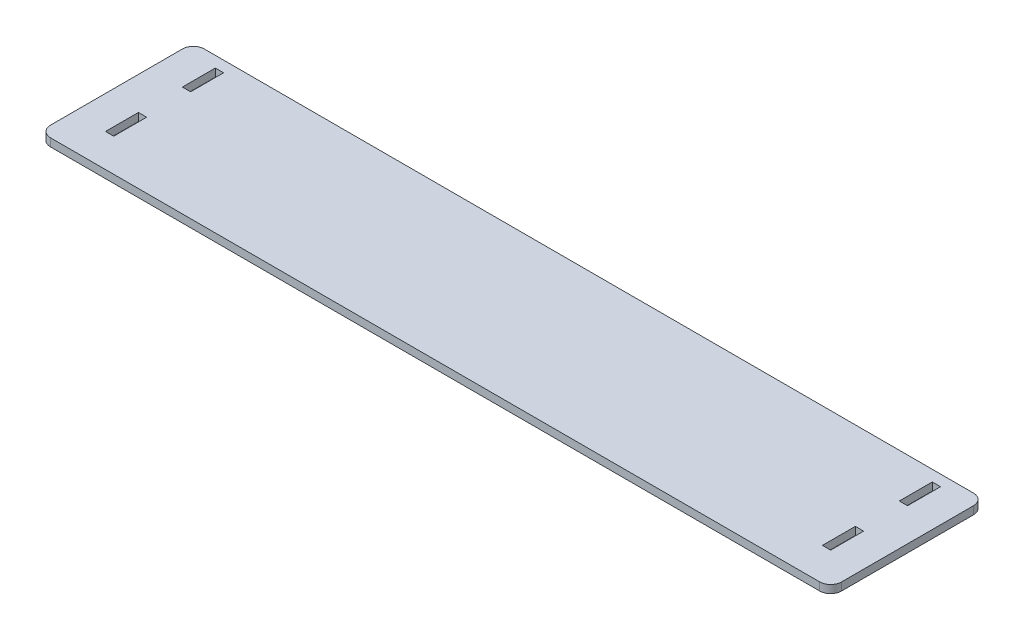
from build123d import *

# Parameters (mm, degrees)
SKETCH1_W           = 1828.8
SKETCH1_H           = 355.6
BOSS_EXTRUDE1_DEPTH = 18.288
FILLET1_R           = 25.4
SKETCH2_W           = 19.05
SKETCH2_H           = 76.2
CUT_EXTRUDE1_DEPTH  = 932.705238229


with BuildPart() as part:
    # Sketch1 → Boss-Extrude1 (new body)
    with BuildSketch(Plane(origin=(0, 0, 0), x_dir=(1, 0, 0), z_dir=(0, 1, 0))):
        Rectangle(SKETCH1_W, SKETCH1_H)
    extrude(amount=BOSS_EXTRUDE1_DEPTH)

    # Fillet1
    fillet1_edges = [part.edges().sort_by_distance(p)[0] for p in [
        (-914.4, 9.144, -177.8),
        (914.4, 9.144, -177.8),
        (914.4, 9.144, 177.8),
        (-914.4, 9.144, 177.8),
    ]]
    fillet(fillet1_edges, radius=FILLET1_R)

    # Sketch2 → Cut-Extrude1 (cut, through all)
    with BuildSketch(Plane(origin=(0, 18.288, 0), x_dir=(1, 0, 0), z_dir=(0, 1, 0))):
        with Locations((-828.675, 114.3)):
            Rectangle(SKETCH2_W, SKETCH2_H)
        with Locations((-828.675, -63.5)):
            Rectangle(SKETCH2_W, SKETCH2_H)
    cut_extrude1 = extrude(amount=-CUT_EXTRUDE1_DEPTH, mode=Mode.SUBTRACT)

    # Mirror1: Cut-Extrude1 across plane
    add(cut_extrude1.mirror(Plane(origin=(0, 0, 0), x_dir=(0, 0, 1), z_dir=(1, 0, 0))), mode=Mode.SUBTRACT)


solid = part.part
